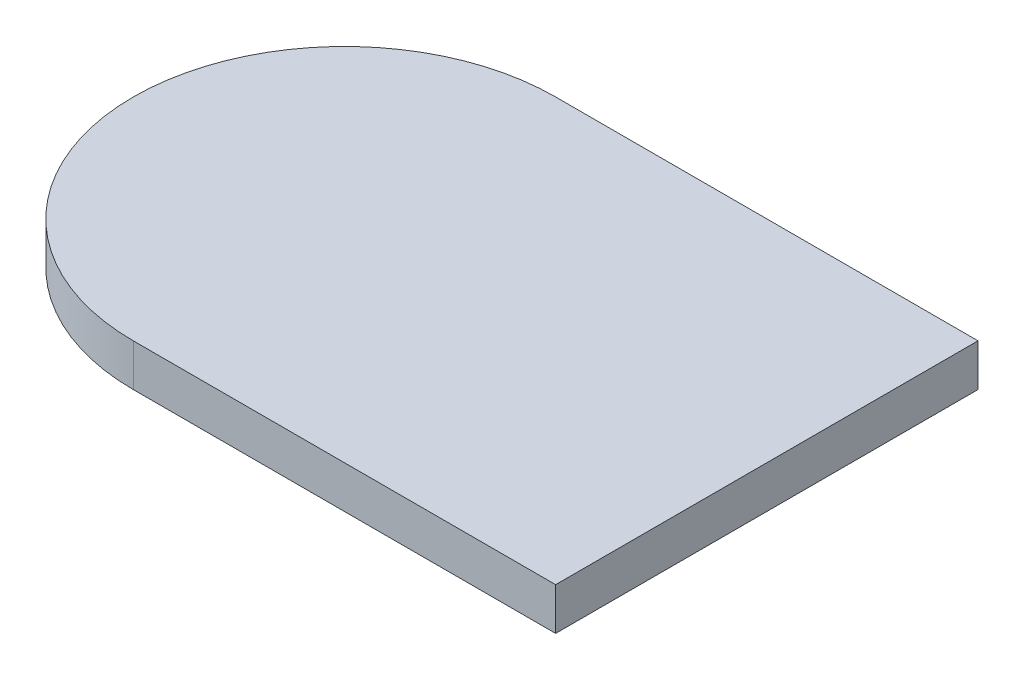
ISO-10303-21;
HEADER;
FILE_DESCRIPTION(('STEP AP214'),'2;1');
FILE_NAME('part.step','',(''),(''),'','','');
FILE_SCHEMA(('AUTOMOTIVE_DESIGN { 1 0 10303 214 1 1 1 1 }'));
ENDSEC;
DATA;
#1=APPLICATION_CONTEXT('core data for automotive mechanical design processes');
#2=APPLICATION_PROTOCOL_DEFINITION('international standard','automotive_design',2000,#1);
#3=PRODUCT_CONTEXT('',#1,'mechanical');
#4=PRODUCT('Part','Part','',(#3));
#5=PRODUCT_RELATED_PRODUCT_CATEGORY('part','',(#4));
#6=PRODUCT_DEFINITION_FORMATION('','',#4);
#7=PRODUCT_DEFINITION_CONTEXT('part definition',#1,'design');
#8=PRODUCT_DEFINITION('design','',#6,#7);
#9=PRODUCT_DEFINITION_SHAPE('','',#8);
#10=(LENGTH_UNIT() NAMED_UNIT(*) SI_UNIT(.MILLI.,.METRE.));
#11=(NAMED_UNIT(*) PLANE_ANGLE_UNIT() SI_UNIT($,.RADIAN.));
#12=(NAMED_UNIT(*) SI_UNIT($,.STERADIAN.) SOLID_ANGLE_UNIT());
#13=UNCERTAINTY_MEASURE_WITH_UNIT(LENGTH_MEASURE(1.E-05),#10,'distance_accuracy_value','');
#14=(GEOMETRIC_REPRESENTATION_CONTEXT(3) GLOBAL_UNCERTAINTY_ASSIGNED_CONTEXT((#13)) GLOBAL_UNIT_ASSIGNED_CONTEXT((#10,
#11,#12)) REPRESENTATION_CONTEXT('',''));
#15=CARTESIAN_POINT('',(0.,0.,0.));
#16=DIRECTION('',(0.,0.,1.));
#17=DIRECTION('',(1.,0.,0.));
#18=AXIS2_PLACEMENT_3D('',#15,#16,#17);
#19=CARTESIAN_POINT('',(0.,5.,-50.));
#20=DIRECTION('',(-1.,0.,0.));
#21=DIRECTION('',(0.,0.,1.));
#22=AXIS2_PLACEMENT_3D('',#19,#20,#21);
#23=PLANE('',#22);
#24=DIRECTION('',(0.,0.,-1.));
#25=VECTOR('',#24,1.);
#26=CARTESIAN_POINT('',(0.,0.,-50.));
#27=LINE('',#26,#25);
#28=CARTESIAN_POINT('',(0.,0.,0.));
#29=VERTEX_POINT('',#28);
#30=CARTESIAN_POINT('',(0.,0.,-50.));
#31=VERTEX_POINT('',#30);
#32=EDGE_CURVE('E77',#29,#31,#27,.T.);
#33=ORIENTED_EDGE('',*,*,#32,.T.);
#34=DIRECTION('',(0.,-1.,0.));
#35=VECTOR('',#34,1.);
#36=CARTESIAN_POINT('',(0.,5.,-50.));
#37=LINE('',#36,#35);
#38=CARTESIAN_POINT('',(0.,5.,-50.));
#39=VERTEX_POINT('',#38);
#40=EDGE_CURVE('E11',#39,#31,#37,.T.);
#41=ORIENTED_EDGE('',*,*,#40,.F.);
#42=DIRECTION('',(0.,0.,-1.));
#43=VECTOR('',#42,1.);
#44=CARTESIAN_POINT('',(0.,5.,-50.));
#45=LINE('',#44,#43);
#46=CARTESIAN_POINT('',(0.,5.,0.));
#47=VERTEX_POINT('',#46);
#48=EDGE_CURVE('E95',#47,#39,#45,.T.);
#49=ORIENTED_EDGE('',*,*,#48,.F.);
#50=DIRECTION('',(0.,-1.,0.));
#51=VECTOR('',#50,1.);
#52=CARTESIAN_POINT('',(0.,5.,0.));
#53=LINE('',#52,#51);
#54=EDGE_CURVE('E89',#47,#29,#53,.T.);
#55=ORIENTED_EDGE('',*,*,#54,.T.);
#56=EDGE_LOOP('',(#33,#41,#49,#55));
#57=FACE_BOUND('',#56,.T.);
#58=ADVANCED_FACE('F33',(#57),#23,.F.);
#59=CARTESIAN_POINT('',(-50.,5.,-50.));
#60=DIRECTION('',(0.,0.,1.));
#61=DIRECTION('',(1.,0.,0.));
#62=AXIS2_PLACEMENT_3D('',#59,#60,#61);
#63=PLANE('',#62);
#64=DIRECTION('',(-1.,0.,0.));
#65=VECTOR('',#64,1.);
#66=CARTESIAN_POINT('',(-50.,0.,-50.));
#67=LINE('',#66,#65);
#68=CARTESIAN_POINT('',(-50.,0.,-50.));
#69=VERTEX_POINT('',#68);
#70=EDGE_CURVE('E73',#31,#69,#67,.T.);
#71=ORIENTED_EDGE('',*,*,#70,.T.);
#72=DIRECTION('',(0.,-1.,0.));
#73=VECTOR('',#72,1.);
#74=CARTESIAN_POINT('',(-50.,5.,-50.));
#75=LINE('',#74,#73);
#76=CARTESIAN_POINT('',(-50.,5.,-50.));
#77=VERTEX_POINT('',#76);
#78=EDGE_CURVE('E40',#77,#69,#75,.T.);
#79=ORIENTED_EDGE('',*,*,#78,.F.);
#80=DIRECTION('',(-1.,0.,0.));
#81=VECTOR('',#80,1.);
#82=CARTESIAN_POINT('',(-50.,5.,-50.));
#83=LINE('',#82,#81);
#84=EDGE_CURVE('E85',#39,#77,#83,.T.);
#85=ORIENTED_EDGE('',*,*,#84,.F.);
#86=ORIENTED_EDGE('',*,*,#40,.T.);
#87=EDGE_LOOP('',(#71,#79,#85,#86));
#88=FACE_BOUND('',#87,.T.);
#89=ADVANCED_FACE('F84',(#88),#63,.F.);
#90=CARTESIAN_POINT('',(-50.,5.,-25.));
#91=DIRECTION('',(0.,-1.,0.));
#92=DIRECTION('',(0.,0.,-1.));
#93=AXIS2_PLACEMENT_3D('',#90,#91,#92);
#94=CYLINDRICAL_SURFACE('',#93,25.);
#95=CARTESIAN_POINT('',(-50.,0.,-25.));
#96=DIRECTION('',(0.,1.,0.));
#97=DIRECTION('',(0.,0.,-1.));
#98=AXIS2_PLACEMENT_3D('',#95,#96,#97);
#99=CIRCLE('',#98,25.);
#100=CARTESIAN_POINT('',(-50.,0.,0.));
#101=VERTEX_POINT('',#100);
#102=EDGE_CURVE('E78',#69,#101,#99,.T.);
#103=ORIENTED_EDGE('',*,*,#102,.T.);
#104=DIRECTION('',(0.,-1.,0.));
#105=VECTOR('',#104,1.);
#106=CARTESIAN_POINT('',(-50.,5.,0.));
#107=LINE('',#106,#105);
#108=CARTESIAN_POINT('',(-50.,5.,0.));
#109=VERTEX_POINT('',#108);
#110=EDGE_CURVE('E101',#109,#101,#107,.T.);
#111=ORIENTED_EDGE('',*,*,#110,.F.);
#112=CARTESIAN_POINT('',(-50.,5.,-25.));
#113=DIRECTION('',(0.,1.,0.));
#114=DIRECTION('',(0.,0.,-1.));
#115=AXIS2_PLACEMENT_3D('',#112,#113,#114);
#116=CIRCLE('',#115,25.);
#117=EDGE_CURVE('E52',#77,#109,#116,.T.);
#118=ORIENTED_EDGE('',*,*,#117,.F.);
#119=ORIENTED_EDGE('',*,*,#78,.T.);
#120=EDGE_LOOP('',(#103,#111,#118,#119));
#121=FACE_BOUND('',#120,.T.);
#122=ADVANCED_FACE('F104',(#121),#94,.T.);
#123=CARTESIAN_POINT('',(0.,5.,0.));
#124=DIRECTION('',(0.,0.,-1.));
#125=DIRECTION('',(-1.,0.,0.));
#126=AXIS2_PLACEMENT_3D('',#123,#124,#125);
#127=PLANE('',#126);
#128=DIRECTION('',(1.,0.,0.));
#129=VECTOR('',#128,1.);
#130=CARTESIAN_POINT('',(0.,0.,0.));
#131=LINE('',#130,#129);
#132=EDGE_CURVE('E93',#101,#29,#131,.T.);
#133=ORIENTED_EDGE('',*,*,#132,.T.);
#134=ORIENTED_EDGE('',*,*,#54,.F.);
#135=DIRECTION('',(1.,0.,0.));
#136=VECTOR('',#135,1.);
#137=CARTESIAN_POINT('',(0.,5.,0.));
#138=LINE('',#137,#136);
#139=EDGE_CURVE('E47',#109,#47,#138,.T.);
#140=ORIENTED_EDGE('',*,*,#139,.F.);
#141=ORIENTED_EDGE('',*,*,#110,.T.);
#142=EDGE_LOOP('',(#133,#134,#140,#141));
#143=FACE_BOUND('',#142,.T.);
#144=ADVANCED_FACE('F106',(#143),#127,.F.);
#145=CARTESIAN_POINT('',(-50.,5.,-25.));
#146=DIRECTION('',(0.,-1.,0.));
#147=DIRECTION('',(0.,0.,-1.));
#148=AXIS2_PLACEMENT_3D('',#145,#146,#147);
#149=PLANE('',#148);
#150=ORIENTED_EDGE('',*,*,#48,.T.);
#151=ORIENTED_EDGE('',*,*,#84,.T.);
#152=ORIENTED_EDGE('',*,*,#117,.T.);
#153=ORIENTED_EDGE('',*,*,#139,.T.);
#154=EDGE_LOOP('',(#150,#151,#152,#153));
#155=FACE_BOUND('',#154,.T.);
#156=ADVANCED_FACE('F107',(#155),#149,.F.);
#157=CARTESIAN_POINT('',(-50.,0.,-25.));
#158=DIRECTION('',(0.,-1.,0.));
#159=DIRECTION('',(0.,0.,-1.));
#160=AXIS2_PLACEMENT_3D('',#157,#158,#159);
#161=PLANE('',#160);
#162=ORIENTED_EDGE('',*,*,#32,.F.);
#163=ORIENTED_EDGE('',*,*,#132,.F.);
#164=ORIENTED_EDGE('',*,*,#102,.F.);
#165=ORIENTED_EDGE('',*,*,#70,.F.);
#166=EDGE_LOOP('',(#162,#163,#164,#165));
#167=FACE_BOUND('',#166,.T.);
#168=ADVANCED_FACE('F74',(#167),#161,.T.);
#169=CLOSED_SHELL('',(#58,#89,#122,#144,#156,#168));
#170=MANIFOLD_SOLID_BREP('B2',#169);
#171=ADVANCED_BREP_SHAPE_REPRESENTATION('',(#18,#170),#14);
#172=SHAPE_DEFINITION_REPRESENTATION(#9,#171);
ENDSEC;
END-ISO-10303-21;
